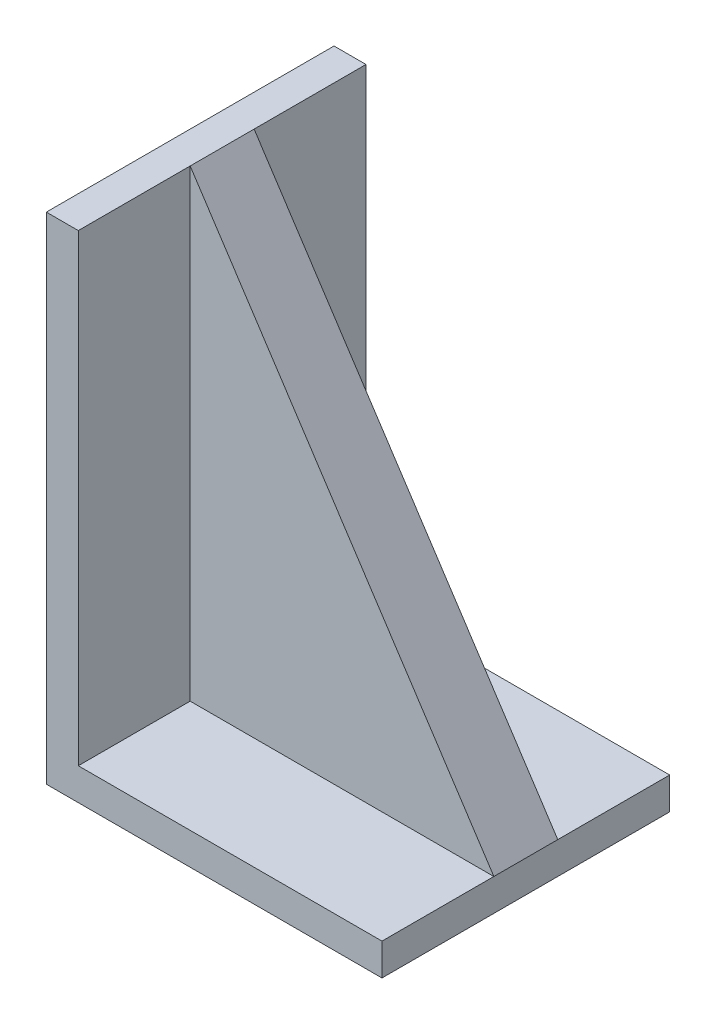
from build123d import *

# Parameters (mm, degrees)
EXTRUDE_THIN1_DEPTH = 22.5
RIB1_REACH          = 94.905
SKETCH2_WALL_W      = 274.483720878
SKETCH2_WALL_H      = 10


with BuildPart() as part:
    # Sketch1 → Extrude-Thin1 (new, symmetric)
    with BuildSketch(Plane.XY):
        Polygon((-2.5, 75), (-2.5, -2.5), (50, -2.5), (50, 2.5), (2.5, 2.5), (2.5, 75), align=None)
    extrude(amount=EXTRUDE_THIN1_DEPTH, both=True)

    # Sketch2 wall → Rib1 (add, up to next)
    with BuildSketch(Plane(origin=(26.25, 38.75, 0), x_dir=(0.548026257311, -0.83646112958, 0), z_dir=(0.83646112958, 0.548026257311, 0)), mode=Mode.PRIVATE) as rib1_sk1:
        Rectangle(SKETCH2_WALL_W, SKETCH2_WALL_H)
    rib1_tool1 = extrude(rib1_sk1.sketch, amount=-RIB1_REACH, mode=Mode.PRIVATE) - part.part
    add(rib1_tool1.solids().sort_by_distance((26.25, 38.75, 0))[0])


solid = part.part
